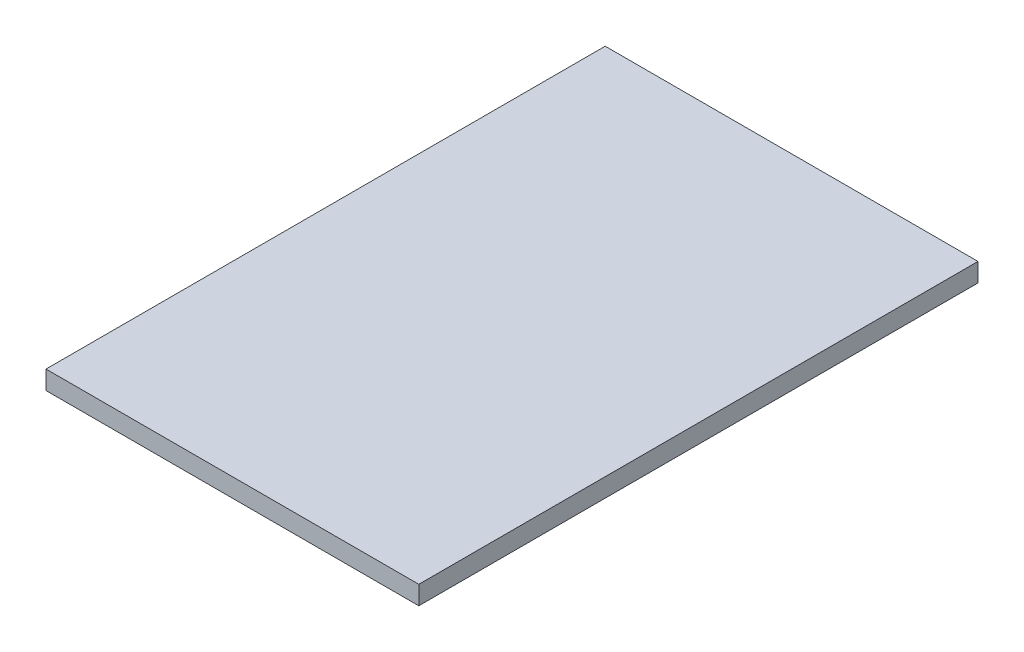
from build123d import *

# Parameters (mm, degrees)
SKETCH1_W           = 20
SKETCH1_H           = 30
BOSS_EXTRUDE1_DEPTH = 1


with BuildPart() as part:
    # Sketch1 → Boss-Extrude1 (new body)
    with BuildSketch(Plane(origin=(0, 0, 0), x_dir=(1, 0, 0), z_dir=(0, 1, 0))):
        with Locations((10, -15)):
            Rectangle(SKETCH1_W, SKETCH1_H)
    extrude(amount=BOSS_EXTRUDE1_DEPTH)


solid = part.part
